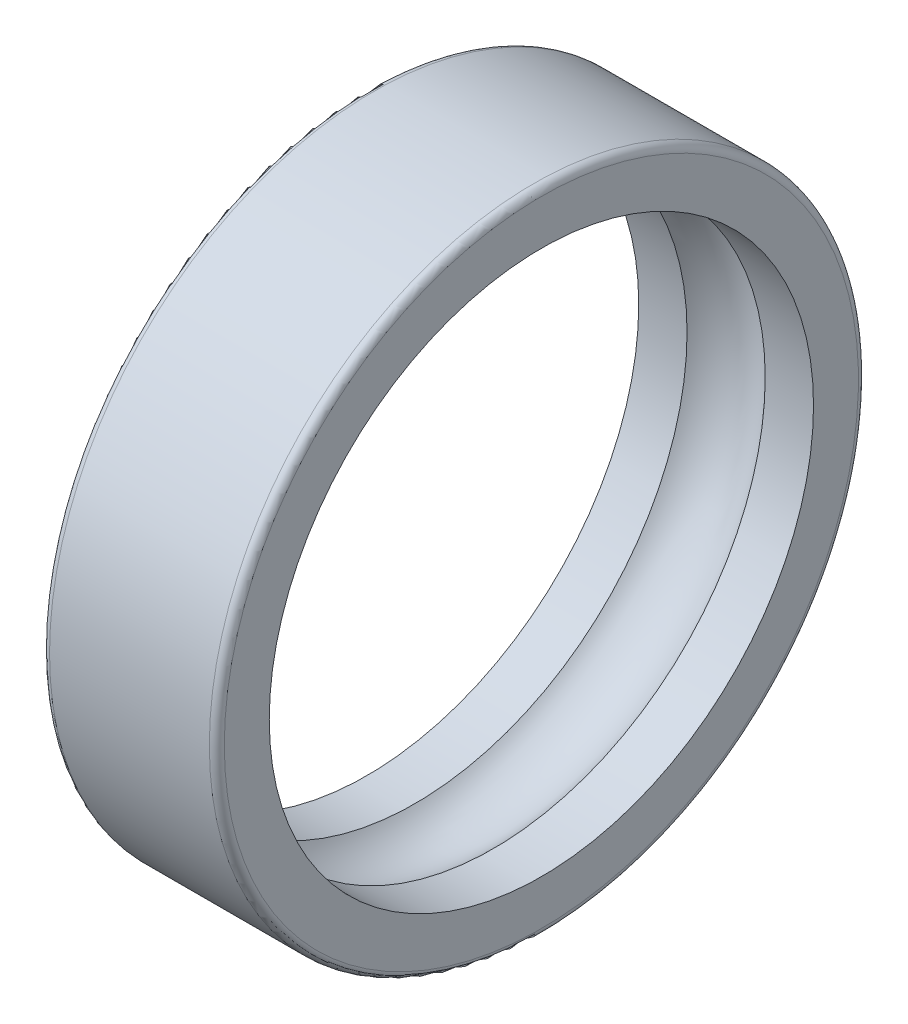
from build123d import *


with BuildPart() as part:
    # Esquisse1 → Base-R_volution (revolve)
    with BuildSketch(Plane(origin=(0, 0, 0), x_dir=(1, 0, 0), z_dir=(0, 1, 0)), mode=Mode.PRIVATE) as base_r_volution_sk:
        with BuildLine():
            Line((0, 6.35), (0, 5.45))
            Line((0, 5.45), (0.967376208, 5.45))
            ThreePointArc((0.967376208, 5.45), (1.75, 5.8), (2.532623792, 5.45))
            Line((2.532623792, 5.45), (3.5, 5.45))
            Line((3.5, 5.45), (3.5, 6.35))
            ThreePointArc((3.5, 6.35), (3.456066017, 6.456066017), (3.35, 6.5))
            Line((3.35, 6.5), (0.15, 6.5))
            ThreePointArc((0.15, 6.5), (0.043933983, 6.456066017), (0, 6.35))
        make_face()
    revolve(base_r_volution_sk.sketch.rotate(Axis((0, 0, 0), (1, 0, 0)), 180), axis=Axis((0, 0, 0), (1, 0, 0)))


solid = part.part
